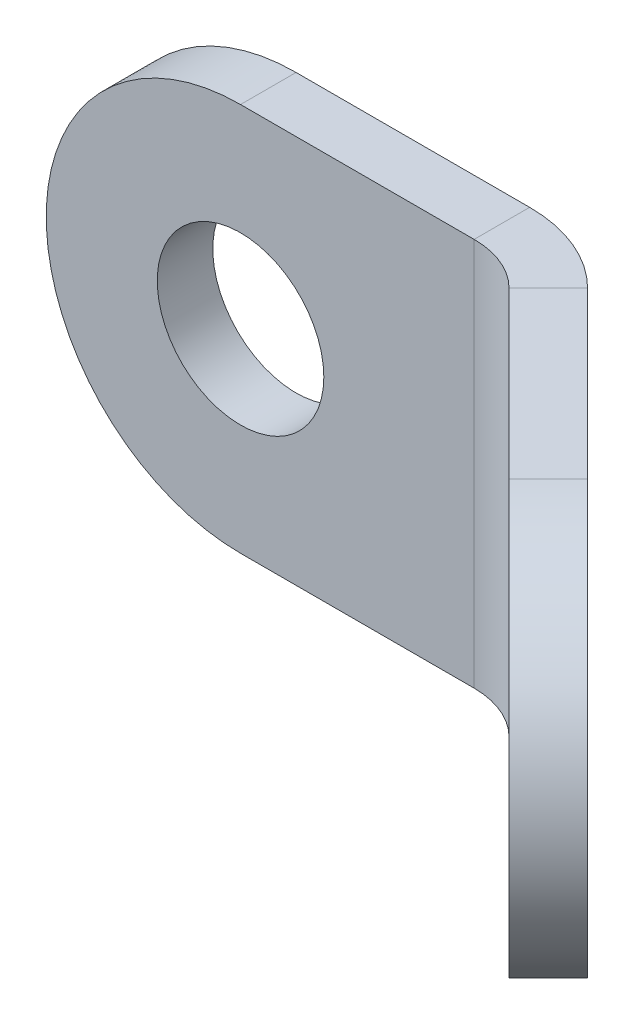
ISO-10303-21;
HEADER;
FILE_DESCRIPTION(('STEP AP214'),'2;1');
FILE_NAME('part.step','',(''),(''),'','','');
FILE_SCHEMA(('AUTOMOTIVE_DESIGN { 1 0 10303 214 1 1 1 1 }'));
ENDSEC;
DATA;
#1=APPLICATION_CONTEXT('core data for automotive mechanical design processes');
#2=APPLICATION_PROTOCOL_DEFINITION('international standard','automotive_design',2000,#1);
#3=PRODUCT_CONTEXT('',#1,'mechanical');
#4=PRODUCT('Part','Part','',(#3));
#5=PRODUCT_RELATED_PRODUCT_CATEGORY('part','',(#4));
#6=PRODUCT_DEFINITION_FORMATION('','',#4);
#7=PRODUCT_DEFINITION_CONTEXT('part definition',#1,'design');
#8=PRODUCT_DEFINITION('design','',#6,#7);
#9=PRODUCT_DEFINITION_SHAPE('','',#8);
#10=(LENGTH_UNIT() NAMED_UNIT(*) SI_UNIT(.MILLI.,.METRE.));
#11=(NAMED_UNIT(*) PLANE_ANGLE_UNIT() SI_UNIT($,.RADIAN.));
#12=(NAMED_UNIT(*) SI_UNIT($,.STERADIAN.) SOLID_ANGLE_UNIT());
#13=UNCERTAINTY_MEASURE_WITH_UNIT(LENGTH_MEASURE(1.E-05),#10,'distance_accuracy_value','');
#14=(GEOMETRIC_REPRESENTATION_CONTEXT(3) GLOBAL_UNCERTAINTY_ASSIGNED_CONTEXT((#13)) GLOBAL_UNIT_ASSIGNED_CONTEXT((#10,
#11,#12)) REPRESENTATION_CONTEXT('',''));
#15=CARTESIAN_POINT('',(0.,0.,0.));
#16=DIRECTION('',(0.,0.,1.));
#17=DIRECTION('',(1.,0.,0.));
#18=AXIS2_PLACEMENT_3D('',#15,#16,#17);
#19=CARTESIAN_POINT('',(-1.03676278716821,0.,2.71269441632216));
#20=DIRECTION('',(-0.707106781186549,0.,0.707106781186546));
#21=DIRECTION('',(0.707106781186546,0.,0.707106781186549));
#22=AXIS2_PLACEMENT_3D('',#19,#20,#21);
#23=PLANE('',#22);
#24=DIRECTION('',(0.707106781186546,0.,0.707106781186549));
#25=VECTOR('',#24,1.);
#26=CARTESIAN_POINT('',(-1.0367627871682,-1.5,2.71269441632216));
#27=LINE('',#26,#25);
#28=CARTESIAN_POINT('',(-2.4509763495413,-1.5,1.29848085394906));
#29=VERTEX_POINT('',#28);
#30=CARTESIAN_POINT('',(-1.0367627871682,-1.5,2.71269441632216));
#31=VERTEX_POINT('',#30);
#32=EDGE_CURVE('E238',#29,#31,#27,.T.);
#33=ORIENTED_EDGE('',*,*,#32,.T.);
#34=CARTESIAN_POINT('',(-1.0367627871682,0.,2.71269441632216));
#35=DIRECTION('',(-0.707106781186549,0.,0.707106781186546));
#36=DIRECTION('',(0.707106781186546,0.,0.707106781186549));
#37=AXIS2_PLACEMENT_3D('',#34,#35,#36);
#38=CIRCLE('',#37,1.5);
#39=CARTESIAN_POINT('',(-1.03676278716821,1.5,2.71269441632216));
#40=VERTEX_POINT('',#39);
#41=EDGE_CURVE('E225',#31,#40,#38,.T.);
#42=ORIENTED_EDGE('',*,*,#41,.T.);
#43=DIRECTION('',(-0.707106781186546,0.,-0.707106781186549));
#44=VECTOR('',#43,1.);
#45=CARTESIAN_POINT('',(-1.03676278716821,1.5,2.71269441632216));
#46=LINE('',#45,#44);
#47=CARTESIAN_POINT('',(-2.4509763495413,1.5,1.29848085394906));
#48=VERTEX_POINT('',#47);
#49=EDGE_CURVE('E229',#40,#48,#46,.T.);
#50=ORIENTED_EDGE('',*,*,#49,.T.);
#51=CARTESIAN_POINT('',(-2.4509763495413,0.,1.29848085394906));
#52=DIRECTION('',(-0.707106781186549,0.,0.707106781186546));
#53=DIRECTION('',(0.707106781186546,0.,0.707106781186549));
#54=AXIS2_PLACEMENT_3D('',#51,#52,#53);
#55=CIRCLE('',#54,1.5);
#56=EDGE_CURVE('E234',#48,#29,#55,.T.);
#57=ORIENTED_EDGE('',*,*,#56,.T.);
#58=EDGE_LOOP('',(#33,#42,#50,#57));
#59=FACE_BOUND('',#58,.T.);
#60=DIRECTION('',(0.707106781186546,0.,0.707106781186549));
#61=VECTOR('',#60,1.);
#62=CARTESIAN_POINT('',(-1.03676278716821,-3.5,2.71269441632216));
#63=LINE('',#62,#61);
#64=CARTESIAN_POINT('',(-4.01168261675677,-3.5,-0.262225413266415));
#65=VERTEX_POINT('',#64);
#66=CARTESIAN_POINT('',(-1.03676278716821,-3.5,2.71269441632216));
#67=VERTEX_POINT('',#66);
#68=EDGE_CURVE('E52',#65,#67,#63,.T.);
#69=ORIENTED_EDGE('',*,*,#68,.F.);
#70=DIRECTION('',(0.,1.,0.));
#71=VECTOR('',#70,1.);
#72=CARTESIAN_POINT('',(-4.01168261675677,0.,-0.262225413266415));
#73=LINE('',#72,#71);
#74=CARTESIAN_POINT('',(-4.01168261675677,3.5,-0.262225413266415));
#75=VERTEX_POINT('',#74);
#76=EDGE_CURVE('E189',#65,#75,#73,.T.);
#77=ORIENTED_EDGE('',*,*,#76,.T.);
#78=DIRECTION('',(-0.707106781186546,0.,-0.707106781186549));
#79=VECTOR('',#78,1.);
#80=CARTESIAN_POINT('',(-1.03676278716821,3.5,2.71269441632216));
#81=LINE('',#80,#79);
#82=CARTESIAN_POINT('',(-1.03676278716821,3.5,2.71269441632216));
#83=VERTEX_POINT('',#82);
#84=EDGE_CURVE('E275',#83,#75,#81,.T.);
#85=ORIENTED_EDGE('',*,*,#84,.F.);
#86=CARTESIAN_POINT('',(-1.03676278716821,0.,2.71269441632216));
#87=DIRECTION('',(-0.707106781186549,0.,0.707106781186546));
#88=DIRECTION('',(0.707106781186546,0.,0.707106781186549));
#89=AXIS2_PLACEMENT_3D('',#86,#87,#88);
#90=CIRCLE('',#89,3.5);
#91=EDGE_CURVE('E271',#67,#83,#90,.T.);
#92=ORIENTED_EDGE('',*,*,#91,.F.);
#93=EDGE_LOOP('',(#69,#77,#85,#92));
#94=FACE_BOUND('',#93,.T.);
#95=ADVANCED_FACE('F48',(#59,#94),#23,.F.);
#96=CARTESIAN_POINT('',(-1.03676278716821,0.,2.71269441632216));
#97=DIRECTION('',(-0.707106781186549,0.,0.707106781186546));
#98=DIRECTION('',(0.707106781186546,0.,0.707106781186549));
#99=AXIS2_PLACEMENT_3D('',#96,#97,#98);
#100=CYLINDRICAL_SURFACE('',#99,3.5);
#101=CARTESIAN_POINT('',(-1.74386956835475,0.,3.4198011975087));
#102=DIRECTION('',(-0.707106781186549,0.,0.707106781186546));
#103=DIRECTION('',(0.707106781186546,0.,0.707106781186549));
#104=AXIS2_PLACEMENT_3D('',#101,#102,#103);
#105=CIRCLE('',#104,3.5);
#106=CARTESIAN_POINT('',(-1.74386956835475,-3.5,3.4198011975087));
#107=VERTEX_POINT('',#106);
#108=CARTESIAN_POINT('',(-1.74386956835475,3.5,3.41980119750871));
#109=VERTEX_POINT('',#108);
#110=EDGE_CURVE('E261',#107,#109,#105,.T.);
#111=ORIENTED_EDGE('',*,*,#110,.F.);
#112=DIRECTION('',(-0.707106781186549,0.,0.707106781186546));
#113=VECTOR('',#112,1.);
#114=CARTESIAN_POINT('',(-1.03676278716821,-3.5,2.71269441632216));
#115=LINE('',#114,#113);
#116=EDGE_CURVE('E278',#67,#107,#115,.T.);
#117=ORIENTED_EDGE('',*,*,#116,.F.);
#118=ORIENTED_EDGE('',*,*,#91,.T.);
#119=DIRECTION('',(-0.707106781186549,0.,0.707106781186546));
#120=VECTOR('',#119,1.);
#121=CARTESIAN_POINT('',(-1.03676278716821,3.5,2.71269441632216));
#122=LINE('',#121,#120);
#123=EDGE_CURVE('E281',#83,#109,#122,.T.);
#124=ORIENTED_EDGE('',*,*,#123,.T.);
#125=EDGE_LOOP('',(#111,#117,#118,#124));
#126=FACE_BOUND('',#125,.T.);
#127=ADVANCED_FACE('F304',(#126),#100,.T.);
#128=CARTESIAN_POINT('',(-1.03676278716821,-3.5,2.71269441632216));
#129=DIRECTION('',(0.,-1.,0.));
#130=DIRECTION('',(0.707106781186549,0.,-0.707106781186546));
#131=AXIS2_PLACEMENT_3D('',#128,#129,#130);
#132=PLANE('',#131);
#133=DIRECTION('',(-0.707106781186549,0.,0.707106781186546));
#134=VECTOR('',#133,1.);
#135=CARTESIAN_POINT('',(-4.01168261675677,-3.5,-0.262225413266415));
#136=LINE('',#135,#134);
#137=CARTESIAN_POINT('',(-4.71878939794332,-3.5,0.444881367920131));
#138=VERTEX_POINT('',#137);
#139=EDGE_CURVE('E286',#65,#138,#136,.T.);
#140=ORIENTED_EDGE('',*,*,#139,.F.);
#141=ORIENTED_EDGE('',*,*,#68,.T.);
#142=ORIENTED_EDGE('',*,*,#116,.T.);
#143=DIRECTION('',(0.707106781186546,0.,0.707106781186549));
#144=VECTOR('',#143,1.);
#145=CARTESIAN_POINT('',(-1.74386956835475,-3.5,3.4198011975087));
#146=LINE('',#145,#144);
#147=EDGE_CURVE('E80',#138,#107,#146,.T.);
#148=ORIENTED_EDGE('',*,*,#147,.F.);
#149=EDGE_LOOP('',(#140,#141,#142,#148));
#150=FACE_BOUND('',#149,.T.);
#151=ADVANCED_FACE('F301',(#150),#132,.T.);
#152=CARTESIAN_POINT('',(-1.03676278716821,3.5,2.71269441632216));
#153=DIRECTION('',(0.,1.,0.));
#154=DIRECTION('',(-0.707106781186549,0.,0.707106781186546));
#155=AXIS2_PLACEMENT_3D('',#152,#153,#154);
#156=PLANE('',#155);
#157=DIRECTION('',(0.707106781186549,0.,-0.707106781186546));
#158=VECTOR('',#157,1.);
#159=CARTESIAN_POINT('',(-4.01168261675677,3.5,-0.262225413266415));
#160=LINE('',#159,#158);
#161=CARTESIAN_POINT('',(-4.71878939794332,3.5,0.444881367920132));
#162=VERTEX_POINT('',#161);
#163=EDGE_CURVE('E12',#162,#75,#160,.T.);
#164=ORIENTED_EDGE('',*,*,#163,.F.);
#165=DIRECTION('',(-0.707106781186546,0.,-0.707106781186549));
#166=VECTOR('',#165,1.);
#167=CARTESIAN_POINT('',(-1.74386956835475,3.5,3.41980119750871));
#168=LINE('',#167,#166);
#169=EDGE_CURVE('E69',#109,#162,#168,.T.);
#170=ORIENTED_EDGE('',*,*,#169,.F.);
#171=ORIENTED_EDGE('',*,*,#123,.F.);
#172=ORIENTED_EDGE('',*,*,#84,.T.);
#173=EDGE_LOOP('',(#164,#170,#171,#172));
#174=FACE_BOUND('',#173,.T.);
#175=ADVANCED_FACE('F50',(#174),#156,.T.);
#176=CARTESIAN_POINT('',(-1.74386956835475,0.,3.4198011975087));
#177=DIRECTION('',(-0.707106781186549,0.,0.707106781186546));
#178=DIRECTION('',(0.707106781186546,0.,0.707106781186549));
#179=AXIS2_PLACEMENT_3D('',#176,#177,#178);
#180=PLANE('',#179);
#181=DIRECTION('',(0.,1.,0.));
#182=VECTOR('',#181,1.);
#183=CARTESIAN_POINT('',(-4.71878939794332,0.,0.444881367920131));
#184=LINE('',#183,#182);
#185=EDGE_CURVE('E58',#138,#162,#184,.T.);
#186=ORIENTED_EDGE('',*,*,#185,.F.);
#187=ORIENTED_EDGE('',*,*,#147,.T.);
#188=ORIENTED_EDGE('',*,*,#110,.T.);
#189=ORIENTED_EDGE('',*,*,#169,.T.);
#190=EDGE_LOOP('',(#186,#187,#188,#189));
#191=FACE_BOUND('',#190,.T.);
#192=CARTESIAN_POINT('',(-1.74386956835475,0.,3.41980119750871));
#193=DIRECTION('',(-0.707106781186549,0.,0.707106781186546));
#194=DIRECTION('',(0.707106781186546,0.,0.707106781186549));
#195=AXIS2_PLACEMENT_3D('',#192,#193,#194);
#196=CIRCLE('',#195,1.5);
#197=CARTESIAN_POINT('',(-1.74386956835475,-1.5,3.41980119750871));
#198=VERTEX_POINT('',#197);
#199=CARTESIAN_POINT('',(-1.74386956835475,1.5,3.41980119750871));
#200=VERTEX_POINT('',#199);
#201=EDGE_CURVE('E243',#198,#200,#196,.T.);
#202=ORIENTED_EDGE('',*,*,#201,.F.);
#203=DIRECTION('',(0.707106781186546,0.,0.707106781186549));
#204=VECTOR('',#203,1.);
#205=CARTESIAN_POINT('',(-1.74386956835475,-1.5,3.41980119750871));
#206=LINE('',#205,#204);
#207=CARTESIAN_POINT('',(-3.15808313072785,-1.5,2.00558763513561));
#208=VERTEX_POINT('',#207);
#209=EDGE_CURVE('E230',#208,#198,#206,.T.);
#210=ORIENTED_EDGE('',*,*,#209,.F.);
#211=CARTESIAN_POINT('',(-3.15808313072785,0.,2.00558763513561));
#212=DIRECTION('',(-0.707106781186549,0.,0.707106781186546));
#213=DIRECTION('',(0.707106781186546,0.,0.707106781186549));
#214=AXIS2_PLACEMENT_3D('',#211,#212,#213);
#215=CIRCLE('',#214,1.5);
#216=CARTESIAN_POINT('',(-3.15808313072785,1.5,2.00558763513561));
#217=VERTEX_POINT('',#216);
#218=EDGE_CURVE('E251',#217,#208,#215,.T.);
#219=ORIENTED_EDGE('',*,*,#218,.F.);
#220=DIRECTION('',(-0.707106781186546,0.,-0.707106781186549));
#221=VECTOR('',#220,1.);
#222=CARTESIAN_POINT('',(-1.74386956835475,1.5,3.41980119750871));
#223=LINE('',#222,#221);
#224=EDGE_CURVE('E246',#200,#217,#223,.T.);
#225=ORIENTED_EDGE('',*,*,#224,.F.);
#226=EDGE_LOOP('',(#202,#210,#219,#225));
#227=FACE_BOUND('',#226,.T.);
#228=ADVANCED_FACE('F297',(#191,#227),#180,.T.);
#229=CARTESIAN_POINT('',(-1.0367627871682,0.,2.71269441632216));
#230=DIRECTION('',(-0.707106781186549,0.,0.707106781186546));
#231=DIRECTION('',(0.707106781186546,0.,0.707106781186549));
#232=AXIS2_PLACEMENT_3D('',#229,#230,#231);
#233=CYLINDRICAL_SURFACE('',#232,1.5);
#234=ORIENTED_EDGE('',*,*,#201,.T.);
#235=DIRECTION('',(-0.707106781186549,0.,0.707106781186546));
#236=VECTOR('',#235,1.);
#237=CARTESIAN_POINT('',(-1.03676278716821,1.5,2.71269441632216));
#238=LINE('',#237,#236);
#239=EDGE_CURVE('E242',#40,#200,#238,.T.);
#240=ORIENTED_EDGE('',*,*,#239,.F.);
#241=ORIENTED_EDGE('',*,*,#41,.F.);
#242=DIRECTION('',(-0.707106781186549,0.,0.707106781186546));
#243=VECTOR('',#242,1.);
#244=CARTESIAN_POINT('',(-1.0367627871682,-1.5,2.71269441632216));
#245=LINE('',#244,#243);
#246=EDGE_CURVE('E258',#31,#198,#245,.T.);
#247=ORIENTED_EDGE('',*,*,#246,.T.);
#248=EDGE_LOOP('',(#234,#240,#241,#247));
#249=FACE_BOUND('',#248,.T.);
#250=ADVANCED_FACE('F369',(#249),#233,.F.);
#251=CARTESIAN_POINT('',(-1.0367627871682,-1.5,2.71269441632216));
#252=DIRECTION('',(0.,-1.,0.));
#253=DIRECTION('',(0.707106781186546,0.,0.707106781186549));
#254=AXIS2_PLACEMENT_3D('',#251,#252,#253);
#255=PLANE('',#254);
#256=ORIENTED_EDGE('',*,*,#209,.T.);
#257=ORIENTED_EDGE('',*,*,#246,.F.);
#258=ORIENTED_EDGE('',*,*,#32,.F.);
#259=DIRECTION('',(-0.707106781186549,0.,0.707106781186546));
#260=VECTOR('',#259,1.);
#261=CARTESIAN_POINT('',(-2.4509763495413,-1.5,1.29848085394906));
#262=LINE('',#261,#260);
#263=EDGE_CURVE('E262',#29,#208,#262,.T.);
#264=ORIENTED_EDGE('',*,*,#263,.T.);
#265=EDGE_LOOP('',(#256,#257,#258,#264));
#266=FACE_BOUND('',#265,.T.);
#267=ADVANCED_FACE('F374',(#266),#255,.F.);
#268=CARTESIAN_POINT('',(-2.4509763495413,0.,1.29848085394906));
#269=DIRECTION('',(-0.707106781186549,0.,0.707106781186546));
#270=DIRECTION('',(0.707106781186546,0.,0.707106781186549));
#271=AXIS2_PLACEMENT_3D('',#268,#269,#270);
#272=CYLINDRICAL_SURFACE('',#271,1.5);
#273=ORIENTED_EDGE('',*,*,#218,.T.);
#274=ORIENTED_EDGE('',*,*,#263,.F.);
#275=ORIENTED_EDGE('',*,*,#56,.F.);
#276=DIRECTION('',(-0.707106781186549,0.,0.707106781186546));
#277=VECTOR('',#276,1.);
#278=CARTESIAN_POINT('',(-2.4509763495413,1.5,1.29848085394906));
#279=LINE('',#278,#277);
#280=EDGE_CURVE('E265',#48,#217,#279,.T.);
#281=ORIENTED_EDGE('',*,*,#280,.T.);
#282=EDGE_LOOP('',(#273,#274,#275,#281));
#283=FACE_BOUND('',#282,.T.);
#284=ADVANCED_FACE('F400',(#283),#272,.F.);
#285=CARTESIAN_POINT('',(-1.03676278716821,1.5,2.71269441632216));
#286=DIRECTION('',(0.,1.,0.));
#287=DIRECTION('',(-0.707106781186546,0.,-0.707106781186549));
#288=AXIS2_PLACEMENT_3D('',#285,#286,#287);
#289=PLANE('',#288);
#290=ORIENTED_EDGE('',*,*,#224,.T.);
#291=ORIENTED_EDGE('',*,*,#280,.F.);
#292=ORIENTED_EDGE('',*,*,#49,.F.);
#293=ORIENTED_EDGE('',*,*,#239,.T.);
#294=EDGE_LOOP('',(#290,#291,#292,#293));
#295=FACE_BOUND('',#294,.T.);
#296=ADVANCED_FACE('F404',(#295),#289,.F.);
#297=CARTESIAN_POINT('',(-10.,0.,-1.));
#298=DIRECTION('',(0.,0.,1.));
#299=DIRECTION('',(1.,0.,0.));
#300=AXIS2_PLACEMENT_3D('',#297,#298,#299);
#301=CYLINDRICAL_SURFACE('',#300,1.5);
#302=CARTESIAN_POINT('',(-10.,0.,-1.));
#303=DIRECTION('',(0.,0.,1.));
#304=DIRECTION('',(1.,0.,0.));
#305=AXIS2_PLACEMENT_3D('',#302,#303,#304);
#306=CIRCLE('',#305,1.5);
#307=CARTESIAN_POINT('',(-8.5,0.,-1.));
#308=VERTEX_POINT('',#307);
#309=EDGE_CURVE('E209',#308,#308,#306,.T.);
#310=ORIENTED_EDGE('',*,*,#309,.F.);
#311=EDGE_LOOP('',(#310));
#312=FACE_BOUND('',#311,.T.);
#313=CARTESIAN_POINT('',(-10.,0.,0.));
#314=DIRECTION('',(0.,0.,1.));
#315=DIRECTION('',(1.,0.,0.));
#316=AXIS2_PLACEMENT_3D('',#313,#314,#315);
#317=CIRCLE('',#316,1.5);
#318=CARTESIAN_POINT('',(-8.5,0.,0.));
#319=VERTEX_POINT('',#318);
#320=EDGE_CURVE('E203',#319,#319,#317,.T.);
#321=ORIENTED_EDGE('',*,*,#320,.T.);
#322=EDGE_LOOP('',(#321));
#323=FACE_BOUND('',#322,.T.);
#324=ADVANCED_FACE('F491',(#312,#323),#301,.F.);
#325=CARTESIAN_POINT('',(-10.,0.,-1.));
#326=DIRECTION('',(0.,0.,1.));
#327=DIRECTION('',(1.,0.,0.));
#328=AXIS2_PLACEMENT_3D('',#325,#326,#327);
#329=CYLINDRICAL_SURFACE('',#328,3.5);
#330=CARTESIAN_POINT('',(-10.,0.,0.));
#331=DIRECTION('',(0.,0.,1.));
#332=DIRECTION('',(1.,0.,0.));
#333=AXIS2_PLACEMENT_3D('',#330,#331,#332);
#334=CIRCLE('',#333,3.5);
#335=CARTESIAN_POINT('',(-10.,3.5,0.));
#336=VERTEX_POINT('',#335);
#337=CARTESIAN_POINT('',(-10.,-3.5,0.));
#338=VERTEX_POINT('',#337);
#339=EDGE_CURVE('E331',#336,#338,#334,.T.);
#340=ORIENTED_EDGE('',*,*,#339,.F.);
#341=DIRECTION('',(0.,0.,1.));
#342=VECTOR('',#341,1.);
#343=CARTESIAN_POINT('',(-10.,3.5,-1.));
#344=LINE('',#343,#342);
#345=CARTESIAN_POINT('',(-10.,3.5,-1.));
#346=VERTEX_POINT('',#345);
#347=EDGE_CURVE('E247',#346,#336,#344,.T.);
#348=ORIENTED_EDGE('',*,*,#347,.F.);
#349=CARTESIAN_POINT('',(-10.,0.,-1.));
#350=DIRECTION('',(0.,0.,1.));
#351=DIRECTION('',(1.,0.,0.));
#352=AXIS2_PLACEMENT_3D('',#349,#350,#351);
#353=CIRCLE('',#352,3.5);
#354=CARTESIAN_POINT('',(-10.,-3.5,-1.));
#355=VERTEX_POINT('',#354);
#356=EDGE_CURVE('E219',#346,#355,#353,.T.);
#357=ORIENTED_EDGE('',*,*,#356,.T.);
#358=DIRECTION('',(0.,0.,1.));
#359=VECTOR('',#358,1.);
#360=CARTESIAN_POINT('',(-10.,-3.5,-1.));
#361=LINE('',#360,#359);
#362=EDGE_CURVE('E206',#355,#338,#361,.T.);
#363=ORIENTED_EDGE('',*,*,#362,.T.);
#364=EDGE_LOOP('',(#340,#348,#357,#363));
#365=FACE_BOUND('',#364,.T.);
#366=ADVANCED_FACE('F344',(#365),#329,.T.);
#367=CARTESIAN_POINT('',(0.,0.,-1.));
#368=DIRECTION('',(0.,0.,1.));
#369=DIRECTION('',(1.,0.,0.));
#370=AXIS2_PLACEMENT_3D('',#367,#368,#369);
#371=PLANE('',#370);
#372=DIRECTION('',(0.,1.,0.));
#373=VECTOR('',#372,1.);
#374=CARTESIAN_POINT('',(-5.79282803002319,0.,-1.));
#375=LINE('',#374,#373);
#376=CARTESIAN_POINT('',(-5.79282803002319,-3.5,-1.));
#377=VERTEX_POINT('',#376);
#378=CARTESIAN_POINT('',(-5.79282803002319,3.5,-1.));
#379=VERTEX_POINT('',#378);
#380=EDGE_CURVE('E186',#377,#379,#375,.T.);
#381=ORIENTED_EDGE('',*,*,#380,.F.);
#382=DIRECTION('',(1.,0.,0.));
#383=VECTOR('',#382,1.);
#384=CARTESIAN_POINT('',(0.,-3.5,-1.));
#385=LINE('',#384,#383);
#386=EDGE_CURVE('E180',#355,#377,#385,.T.);
#387=ORIENTED_EDGE('',*,*,#386,.F.);
#388=ORIENTED_EDGE('',*,*,#356,.F.);
#389=DIRECTION('',(-1.,0.,0.));
#390=VECTOR('',#389,1.);
#391=CARTESIAN_POINT('',(0.,3.5,-1.));
#392=LINE('',#391,#390);
#393=EDGE_CURVE('E200',#379,#346,#392,.T.);
#394=ORIENTED_EDGE('',*,*,#393,.F.);
#395=EDGE_LOOP('',(#381,#387,#388,#394));
#396=FACE_BOUND('',#395,.T.);
#397=ORIENTED_EDGE('',*,*,#309,.T.);
#398=EDGE_LOOP('',(#397));
#399=FACE_BOUND('',#398,.T.);
#400=ADVANCED_FACE('F197',(#396,#399),#371,.F.);
#401=CARTESIAN_POINT('',(0.,-3.5,-1.));
#402=DIRECTION('',(0.,-1.,0.));
#403=DIRECTION('',(0.,0.,-1.));
#404=AXIS2_PLACEMENT_3D('',#401,#402,#403);
#405=PLANE('',#404);
#406=ORIENTED_EDGE('',*,*,#386,.T.);
#407=DIRECTION('',(0.,0.,1.));
#408=VECTOR('',#407,1.);
#409=CARTESIAN_POINT('',(-5.79282803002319,-3.5,-1.));
#410=LINE('',#409,#408);
#411=CARTESIAN_POINT('',(-5.79282803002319,-3.5,0.));
#412=VERTEX_POINT('',#411);
#413=EDGE_CURVE('E166',#377,#412,#410,.T.);
#414=ORIENTED_EDGE('',*,*,#413,.T.);
#415=DIRECTION('',(1.,0.,0.));
#416=VECTOR('',#415,1.);
#417=CARTESIAN_POINT('',(0.,-3.5,0.));
#418=LINE('',#417,#416);
#419=EDGE_CURVE('E179',#338,#412,#418,.T.);
#420=ORIENTED_EDGE('',*,*,#419,.F.);
#421=ORIENTED_EDGE('',*,*,#362,.F.);
#422=EDGE_LOOP('',(#406,#414,#420,#421));
#423=FACE_BOUND('',#422,.T.);
#424=ADVANCED_FACE('F205',(#423),#405,.T.);
#425=CARTESIAN_POINT('',(0.,0.,0.));
#426=DIRECTION('',(0.,0.,1.));
#427=DIRECTION('',(1.,0.,0.));
#428=AXIS2_PLACEMENT_3D('',#425,#426,#427);
#429=PLANE('',#428);
#430=ORIENTED_EDGE('',*,*,#320,.F.);
#431=EDGE_LOOP('',(#430));
#432=FACE_BOUND('',#431,.T.);
#433=ORIENTED_EDGE('',*,*,#419,.T.);
#434=DIRECTION('',(0.,1.,0.));
#435=VECTOR('',#434,1.);
#436=CARTESIAN_POINT('',(-5.79282803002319,0.,0.));
#437=LINE('',#436,#435);
#438=CARTESIAN_POINT('',(-5.79282803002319,3.5,0.));
#439=VERTEX_POINT('',#438);
#440=EDGE_CURVE('E318',#412,#439,#437,.T.);
#441=ORIENTED_EDGE('',*,*,#440,.T.);
#442=DIRECTION('',(-1.,0.,0.));
#443=VECTOR('',#442,1.);
#444=CARTESIAN_POINT('',(0.,3.5,0.));
#445=LINE('',#444,#443);
#446=EDGE_CURVE('E335',#439,#336,#445,.T.);
#447=ORIENTED_EDGE('',*,*,#446,.T.);
#448=ORIENTED_EDGE('',*,*,#339,.T.);
#449=EDGE_LOOP('',(#433,#441,#447,#448));
#450=FACE_BOUND('',#449,.T.);
#451=ADVANCED_FACE('F340',(#432,#450),#429,.T.);
#452=CARTESIAN_POINT('',(0.,3.5,-1.));
#453=DIRECTION('',(0.,1.,0.));
#454=DIRECTION('',(0.,0.,1.));
#455=AXIS2_PLACEMENT_3D('',#452,#453,#454);
#456=PLANE('',#455);
#457=ORIENTED_EDGE('',*,*,#446,.F.);
#458=DIRECTION('',(0.,0.,-1.));
#459=VECTOR('',#458,1.);
#460=CARTESIAN_POINT('',(-5.79282803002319,3.5,-1.));
#461=LINE('',#460,#459);
#462=EDGE_CURVE('E311',#439,#379,#461,.T.);
#463=ORIENTED_EDGE('',*,*,#462,.T.);
#464=ORIENTED_EDGE('',*,*,#393,.T.);
#465=ORIENTED_EDGE('',*,*,#347,.T.);
#466=EDGE_LOOP('',(#457,#463,#464,#465));
#467=FACE_BOUND('',#466,.T.);
#468=ADVANCED_FACE('F346',(#467),#456,.T.);
#469=CARTESIAN_POINT('',(-5.79282803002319,-3.5,1.51892));
#470=DIRECTION('',(0.,-1.,0.));
#471=DIRECTION('',(0.,0.,-1.));
#472=AXIS2_PLACEMENT_3D('',#469,#470,#471);
#473=PLANE('',#472);
#474=ORIENTED_EDGE('',*,*,#139,.T.);
#475=CARTESIAN_POINT('',(-5.79282803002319,-3.5,1.51892));
#476=DIRECTION('',(0.,-1.,0.));
#477=DIRECTION('',(1.,0.,0.));
#478=AXIS2_PLACEMENT_3D('',#475,#476,#477);
#479=CIRCLE('',#478,1.51892);
#480=EDGE_CURVE('E173',#138,#412,#479,.F.);
#481=ORIENTED_EDGE('',*,*,#480,.T.);
#482=ORIENTED_EDGE('',*,*,#413,.F.);
#483=CARTESIAN_POINT('',(-5.79282803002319,-3.5,1.51892));
#484=DIRECTION('',(0.,1.,0.));
#485=DIRECTION('',(0.,0.,-1.));
#486=AXIS2_PLACEMENT_3D('',#483,#484,#485);
#487=CIRCLE('',#486,2.51892);
#488=EDGE_CURVE('E170',#65,#377,#487,.T.);
#489=ORIENTED_EDGE('',*,*,#488,.F.);
#490=EDGE_LOOP('',(#474,#481,#482,#489));
#491=FACE_BOUND('',#490,.T.);
#492=ADVANCED_FACE('F169',(#491),#473,.T.);
#493=CARTESIAN_POINT('',(-5.79282803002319,3.5,1.51892));
#494=DIRECTION('',(0.,1.,0.));
#495=DIRECTION('',(0.,0.,1.));
#496=AXIS2_PLACEMENT_3D('',#493,#494,#495);
#497=PLANE('',#496);
#498=ORIENTED_EDGE('',*,*,#462,.F.);
#499=CARTESIAN_POINT('',(-5.79282803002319,3.5,1.51892));
#500=DIRECTION('',(0.,-1.,0.));
#501=DIRECTION('',(1.,0.,0.));
#502=AXIS2_PLACEMENT_3D('',#499,#500,#501);
#503=CIRCLE('',#502,1.51892);
#504=EDGE_CURVE('E192',#439,#162,#503,.T.);
#505=ORIENTED_EDGE('',*,*,#504,.T.);
#506=ORIENTED_EDGE('',*,*,#163,.T.);
#507=CARTESIAN_POINT('',(-5.79282803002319,3.5,1.51892));
#508=DIRECTION('',(0.,-1.,0.));
#509=DIRECTION('',(0.,0.,1.));
#510=AXIS2_PLACEMENT_3D('',#507,#508,#509);
#511=CIRCLE('',#510,2.51892);
#512=EDGE_CURVE('E191',#379,#75,#511,.T.);
#513=ORIENTED_EDGE('',*,*,#512,.F.);
#514=EDGE_LOOP('',(#498,#505,#506,#513));
#515=FACE_BOUND('',#514,.T.);
#516=ADVANCED_FACE('F310',(#515),#497,.T.);
#517=CARTESIAN_POINT('',(-5.79282803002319,7.24667545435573,1.51892));
#518=DIRECTION('',(0.,-1.,0.));
#519=DIRECTION('',(1.,0.,0.));
#520=AXIS2_PLACEMENT_3D('',#517,#518,#519);
#521=CYLINDRICAL_SURFACE('',#520,2.51892);
#522=ORIENTED_EDGE('',*,*,#512,.T.);
#523=ORIENTED_EDGE('',*,*,#76,.F.);
#524=ORIENTED_EDGE('',*,*,#488,.T.);
#525=ORIENTED_EDGE('',*,*,#380,.T.);
#526=EDGE_LOOP('',(#522,#523,#524,#525));
#527=FACE_BOUND('',#526,.T.);
#528=ADVANCED_FACE('F185',(#527),#521,.T.);
#529=CARTESIAN_POINT('',(-5.79282803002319,7.24667545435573,1.51892));
#530=DIRECTION('',(0.,-1.,0.));
#531=DIRECTION('',(1.,0.,0.));
#532=AXIS2_PLACEMENT_3D('',#529,#530,#531);
#533=CYLINDRICAL_SURFACE('',#532,1.51892);
#534=ORIENTED_EDGE('',*,*,#504,.F.);
#535=ORIENTED_EDGE('',*,*,#440,.F.);
#536=ORIENTED_EDGE('',*,*,#480,.F.);
#537=ORIENTED_EDGE('',*,*,#185,.T.);
#538=EDGE_LOOP('',(#534,#535,#536,#537));
#539=FACE_BOUND('',#538,.T.);
#540=ADVANCED_FACE('F316',(#539),#533,.F.);
#541=CLOSED_SHELL('',(#95,#127,#151,#175,#228,#250,#267,#284,#296,#324,#366,#400,#424,#451,#468,
#492,#516,#528,#540));
#542=MANIFOLD_SOLID_BREP('B2',#541);
#543=ADVANCED_BREP_SHAPE_REPRESENTATION('',(#18,#542),#14);
#544=SHAPE_DEFINITION_REPRESENTATION(#9,#543);
ENDSEC;
END-ISO-10303-21;
